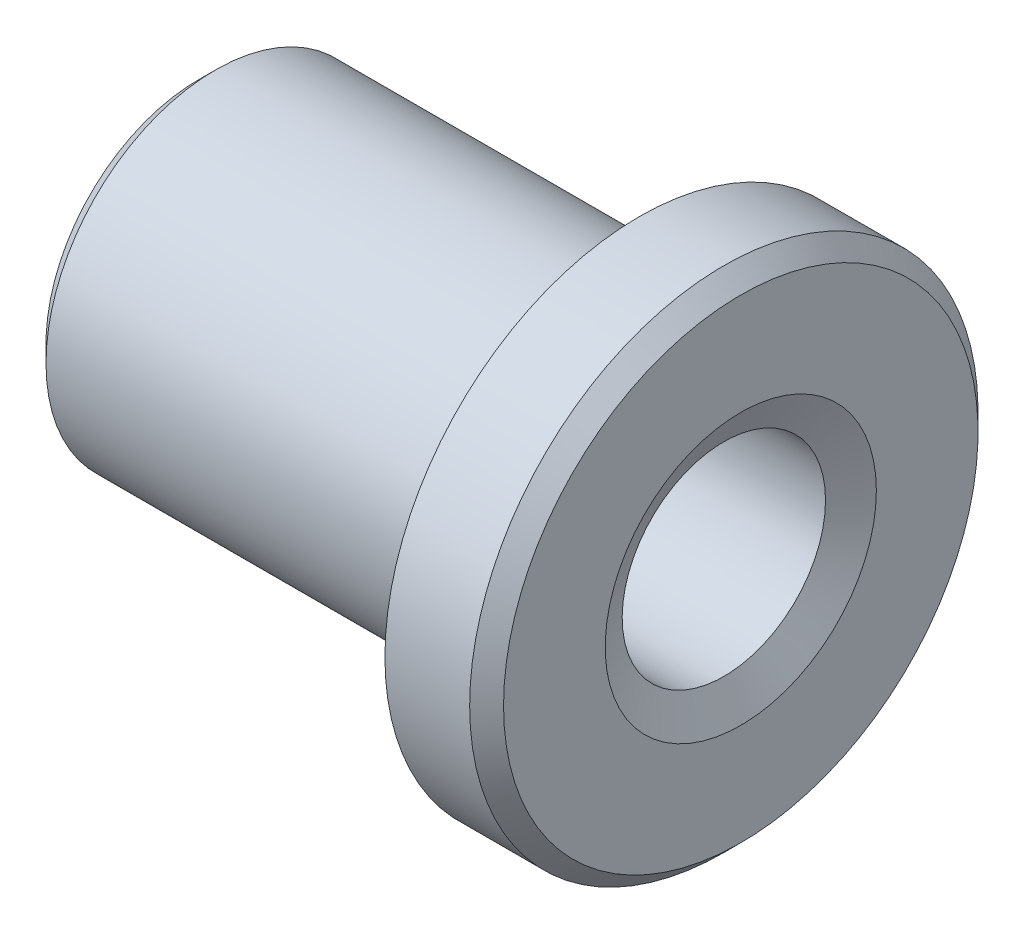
ISO-10303-21;
HEADER;
FILE_DESCRIPTION(('STEP AP214'),'2;1');
FILE_NAME('part.step','',(''),(''),'','','');
FILE_SCHEMA(('AUTOMOTIVE_DESIGN { 1 0 10303 214 1 1 1 1 }'));
ENDSEC;
DATA;
#1=APPLICATION_CONTEXT('core data for automotive mechanical design processes');
#2=APPLICATION_PROTOCOL_DEFINITION('international standard','automotive_design',2000,#1);
#3=PRODUCT_CONTEXT('',#1,'mechanical');
#4=PRODUCT('Part','Part','',(#3));
#5=PRODUCT_RELATED_PRODUCT_CATEGORY('part','',(#4));
#6=PRODUCT_DEFINITION_FORMATION('','',#4);
#7=PRODUCT_DEFINITION_CONTEXT('part definition',#1,'design');
#8=PRODUCT_DEFINITION('design','',#6,#7);
#9=PRODUCT_DEFINITION_SHAPE('','',#8);
#10=(LENGTH_UNIT() NAMED_UNIT(*) SI_UNIT(.MILLI.,.METRE.));
#11=(NAMED_UNIT(*) PLANE_ANGLE_UNIT() SI_UNIT($,.RADIAN.));
#12=(NAMED_UNIT(*) SI_UNIT($,.STERADIAN.) SOLID_ANGLE_UNIT());
#13=UNCERTAINTY_MEASURE_WITH_UNIT(LENGTH_MEASURE(1.E-05),#10,'distance_accuracy_value','');
#14=(GEOMETRIC_REPRESENTATION_CONTEXT(3) GLOBAL_UNCERTAINTY_ASSIGNED_CONTEXT((#13)) GLOBAL_UNIT_ASSIGNED_CONTEXT((#10,
#11,#12)) REPRESENTATION_CONTEXT('',''));
#15=CARTESIAN_POINT('',(0.,0.,0.));
#16=DIRECTION('',(0.,0.,1.));
#17=DIRECTION('',(1.,0.,0.));
#18=AXIS2_PLACEMENT_3D('',#15,#16,#17);
#19=CARTESIAN_POINT('',(-13.,-6.2856101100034,0.99554283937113));
#20=DIRECTION('',(-1.,0.,0.));
#21=DIRECTION('',(0.,0.809016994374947,0.587785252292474));
#22=AXIS2_PLACEMENT_3D('',#19,#20,#21);
#23=PLANE('',#22);
#24=CARTESIAN_POINT('',(-13.,0.,0.));
#25=DIRECTION('',(-1.,0.,0.));
#26=DIRECTION('',(0.,0.,1.));
#27=AXIS2_PLACEMENT_3D('',#24,#25,#26);
#28=CIRCLE('',#27,3.50000000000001);
#29=CARTESIAN_POINT('',(-13.,0.,3.50000000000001));
#30=VERTEX_POINT('',#29);
#31=EDGE_CURVE('E50',#30,#30,#28,.T.);
#32=ORIENTED_EDGE('',*,*,#31,.F.);
#33=EDGE_LOOP('',(#32));
#34=FACE_BOUND('',#33,.T.);
#35=CARTESIAN_POINT('',(-13.,0.,0.));
#36=DIRECTION('',(1.,0.,0.));
#37=DIRECTION('',(0.,0.,-1.));
#38=AXIS2_PLACEMENT_3D('',#35,#36,#37);
#39=CIRCLE('',#38,4.50000000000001);
#40=CARTESIAN_POINT('',(-13.,0.,-4.50000000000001));
#41=VERTEX_POINT('',#40);
#42=EDGE_CURVE('E54',#41,#41,#39,.F.);
#43=ORIENTED_EDGE('',*,*,#42,.T.);
#44=EDGE_LOOP('',(#43));
#45=FACE_BOUND('',#44,.T.);
#46=ADVANCED_FACE('F14',(#34,#45),#23,.T.);
#47=CARTESIAN_POINT('',(-12.5,0.,0.));
#48=DIRECTION('',(1.,0.,0.));
#49=DIRECTION('',(0.,0.,-1.));
#50=AXIS2_PLACEMENT_3D('',#47,#48,#49);
#51=CONICAL_SURFACE('',#50,4.99999999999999,0.785398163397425);
#52=CARTESIAN_POINT('',(-12.5,0.,0.));
#53=DIRECTION('',(-1.,0.,0.));
#54=DIRECTION('',(0.,0.809016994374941,0.587785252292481));
#55=AXIS2_PLACEMENT_3D('',#52,#53,#54);
#56=CIRCLE('',#55,4.99999999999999);
#57=CARTESIAN_POINT('',(-12.5,4.0450849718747,2.9389262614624));
#58=VERTEX_POINT('',#57);
#59=EDGE_CURVE('E53',#58,#58,#56,.T.);
#60=ORIENTED_EDGE('',*,*,#59,.T.);
#61=EDGE_LOOP('',(#60));
#62=FACE_BOUND('',#61,.T.);
#63=ORIENTED_EDGE('',*,*,#42,.F.);
#64=EDGE_LOOP('',(#63));
#65=FACE_BOUND('',#64,.T.);
#66=ADVANCED_FACE('F60',(#62,#65),#51,.T.);
#67=CARTESIAN_POINT('',(-12.5,0.,0.));
#68=DIRECTION('',(-1.,0.,0.));
#69=DIRECTION('',(0.,0.,1.));
#70=AXIS2_PLACEMENT_3D('',#67,#68,#69);
#71=CONICAL_SURFACE('',#70,2.99999999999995,0.785398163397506);
#72=ORIENTED_EDGE('',*,*,#31,.T.);
#73=EDGE_LOOP('',(#72));
#74=FACE_BOUND('',#73,.T.);
#75=CARTESIAN_POINT('',(-12.5,0.,0.));
#76=DIRECTION('',(-1.,0.,0.));
#77=DIRECTION('',(0.,0.809016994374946,0.587785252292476));
#78=AXIS2_PLACEMENT_3D('',#75,#76,#77);
#79=CIRCLE('',#78,2.99999999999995);
#80=CARTESIAN_POINT('',(-12.5,2.4270509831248,1.7633557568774));
#81=VERTEX_POINT('',#80);
#82=EDGE_CURVE('E47',#81,#81,#79,.T.);
#83=ORIENTED_EDGE('',*,*,#82,.F.);
#84=EDGE_LOOP('',(#83));
#85=FACE_BOUND('',#84,.T.);
#86=ADVANCED_FACE('F62',(#74,#85),#71,.F.);
#87=CARTESIAN_POINT('',(0.,0.,0.));
#88=DIRECTION('',(-1.,0.,0.));
#89=DIRECTION('',(0.,0.,1.));
#90=AXIS2_PLACEMENT_3D('',#87,#88,#89);
#91=CYLINDRICAL_SURFACE('',#90,4.99999999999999);
#92=CARTESIAN_POINT('',(0.,0.,0.));
#93=DIRECTION('',(-1.,0.,0.));
#94=DIRECTION('',(0.,0.,1.));
#95=AXIS2_PLACEMENT_3D('',#92,#93,#94);
#96=CIRCLE('',#95,4.99999999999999);
#97=CARTESIAN_POINT('',(0.,0.,4.99999999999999));
#98=VERTEX_POINT('',#97);
#99=EDGE_CURVE('E44',#98,#98,#96,.F.);
#100=ORIENTED_EDGE('',*,*,#99,.F.);
#101=EDGE_LOOP('',(#100));
#102=FACE_BOUND('',#101,.T.);
#103=ORIENTED_EDGE('',*,*,#59,.F.);
#104=EDGE_LOOP('',(#103));
#105=FACE_BOUND('',#104,.T.);
#106=ADVANCED_FACE('F70',(#102,#105),#91,.T.);
#107=CARTESIAN_POINT('',(2.5,0.,0.));
#108=DIRECTION('',(-1.,0.,0.));
#109=DIRECTION('',(0.,0.,1.));
#110=AXIS2_PLACEMENT_3D('',#107,#108,#109);
#111=CYLINDRICAL_SURFACE('',#110,2.99999999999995);
#112=ORIENTED_EDGE('',*,*,#82,.T.);
#113=EDGE_LOOP('',(#112));
#114=FACE_BOUND('',#113,.T.);
#115=CARTESIAN_POINT('',(2.5,0.,0.));
#116=DIRECTION('',(-1.,0.,0.));
#117=DIRECTION('',(0.,0.809016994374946,0.587785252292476));
#118=AXIS2_PLACEMENT_3D('',#115,#116,#117);
#119=CIRCLE('',#118,2.99999999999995);
#120=CARTESIAN_POINT('',(2.5,2.4270509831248,1.7633557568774));
#121=VERTEX_POINT('',#120);
#122=EDGE_CURVE('E41',#121,#121,#119,.T.);
#123=ORIENTED_EDGE('',*,*,#122,.F.);
#124=EDGE_LOOP('',(#123));
#125=FACE_BOUND('',#124,.T.);
#126=ADVANCED_FACE('F93',(#114,#125),#111,.F.);
#127=CARTESIAN_POINT('',(0.,-10.476016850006,1.6592380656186));
#128=DIRECTION('',(-1.,0.,0.));
#129=DIRECTION('',(0.,0.809016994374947,0.587785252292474));
#130=AXIS2_PLACEMENT_3D('',#127,#128,#129);
#131=PLANE('',#130);
#132=ORIENTED_EDGE('',*,*,#99,.T.);
#133=EDGE_LOOP('',(#132));
#134=FACE_BOUND('',#133,.T.);
#135=CARTESIAN_POINT('',(0.,0.,0.));
#136=DIRECTION('',(-1.,0.,0.));
#137=DIRECTION('',(0.,0.,1.));
#138=AXIS2_PLACEMENT_3D('',#135,#136,#137);
#139=CIRCLE('',#138,7.49999999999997);
#140=CARTESIAN_POINT('',(0.,0.,7.49999999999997));
#141=VERTEX_POINT('',#140);
#142=EDGE_CURVE('E36',#141,#141,#139,.T.);
#143=ORIENTED_EDGE('',*,*,#142,.T.);
#144=EDGE_LOOP('',(#143));
#145=FACE_BOUND('',#144,.T.);
#146=ADVANCED_FACE('F90',(#134,#145),#131,.T.);
#147=CARTESIAN_POINT('',(3.,0.,0.));
#148=DIRECTION('',(1.,0.,0.));
#149=DIRECTION('',(0.,0.,-1.));
#150=AXIS2_PLACEMENT_3D('',#147,#148,#149);
#151=CONICAL_SURFACE('',#150,4.00000000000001,1.10714871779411);
#152=ORIENTED_EDGE('',*,*,#122,.T.);
#153=EDGE_LOOP('',(#152));
#154=FACE_BOUND('',#153,.T.);
#155=CARTESIAN_POINT('',(3.,0.,0.));
#156=DIRECTION('',(1.,0.,0.));
#157=DIRECTION('',(0.,0.,-1.));
#158=AXIS2_PLACEMENT_3D('',#155,#156,#157);
#159=CIRCLE('',#158,4.00000000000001);
#160=CARTESIAN_POINT('',(3.,0.,-4.00000000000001));
#161=VERTEX_POINT('',#160);
#162=EDGE_CURVE('E27',#161,#161,#159,.F.);
#163=ORIENTED_EDGE('',*,*,#162,.F.);
#164=EDGE_LOOP('',(#163));
#165=FACE_BOUND('',#164,.T.);
#166=ADVANCED_FACE('F92',(#154,#165),#151,.F.);
#167=CARTESIAN_POINT('',(2.5,0.,0.));
#168=DIRECTION('',(-1.,0.,0.));
#169=DIRECTION('',(0.,0.,1.));
#170=AXIS2_PLACEMENT_3D('',#167,#168,#169);
#171=CYLINDRICAL_SURFACE('',#170,7.49999999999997);
#172=CARTESIAN_POINT('',(2.5,0.,0.));
#173=DIRECTION('',(-1.,0.,0.));
#174=DIRECTION('',(0.,0.80901699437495,0.587785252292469));
#175=AXIS2_PLACEMENT_3D('',#172,#173,#174);
#176=CIRCLE('',#175,7.49999999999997);
#177=CARTESIAN_POINT('',(2.5,6.0676274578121,4.4083893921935));
#178=VERTEX_POINT('',#177);
#179=EDGE_CURVE('E22',#178,#178,#176,.T.);
#180=ORIENTED_EDGE('',*,*,#179,.T.);
#181=EDGE_LOOP('',(#180));
#182=FACE_BOUND('',#181,.T.);
#183=ORIENTED_EDGE('',*,*,#142,.F.);
#184=EDGE_LOOP('',(#183));
#185=FACE_BOUND('',#184,.T.);
#186=ADVANCED_FACE('F85',(#182,#185),#171,.T.);
#187=CARTESIAN_POINT('',(3.,-1.5486221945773,-9.7776157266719));
#188=DIRECTION('',(1.,0.,0.));
#189=DIRECTION('',(0.,0.809016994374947,0.587785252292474));
#190=AXIS2_PLACEMENT_3D('',#187,#188,#189);
#191=PLANE('',#190);
#192=ORIENTED_EDGE('',*,*,#162,.T.);
#193=EDGE_LOOP('',(#192));
#194=FACE_BOUND('',#193,.T.);
#195=CARTESIAN_POINT('',(3.,0.,0.));
#196=DIRECTION('',(-1.,0.,0.));
#197=DIRECTION('',(0.,0.,1.));
#198=AXIS2_PLACEMENT_3D('',#195,#196,#197);
#199=CIRCLE('',#198,6.99999999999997);
#200=CARTESIAN_POINT('',(3.,0.,6.99999999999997));
#201=VERTEX_POINT('',#200);
#202=EDGE_CURVE('E10',#201,#201,#199,.F.);
#203=ORIENTED_EDGE('',*,*,#202,.T.);
#204=EDGE_LOOP('',(#203));
#205=FACE_BOUND('',#204,.T.);
#206=ADVANCED_FACE('F16',(#194,#205),#191,.T.);
#207=CARTESIAN_POINT('',(3.,0.,0.));
#208=DIRECTION('',(-1.,0.,0.));
#209=DIRECTION('',(0.,0.,1.));
#210=AXIS2_PLACEMENT_3D('',#207,#208,#209);
#211=CONICAL_SURFACE('',#210,6.99999999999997,0.78539816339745);
#212=ORIENTED_EDGE('',*,*,#202,.F.);
#213=EDGE_LOOP('',(#212));
#214=FACE_BOUND('',#213,.T.);
#215=ORIENTED_EDGE('',*,*,#179,.F.);
#216=EDGE_LOOP('',(#215));
#217=FACE_BOUND('',#216,.T.);
#218=ADVANCED_FACE('F77',(#214,#217),#211,.T.);
#219=CLOSED_SHELL('',(#46,#66,#86,#106,#126,#146,#166,#186,#206,#218));
#220=MANIFOLD_SOLID_BREP('B1',#219);
#221=ADVANCED_BREP_SHAPE_REPRESENTATION('',(#18,#220),#14);
#222=SHAPE_DEFINITION_REPRESENTATION(#9,#221);
ENDSEC;
END-ISO-10303-21;
